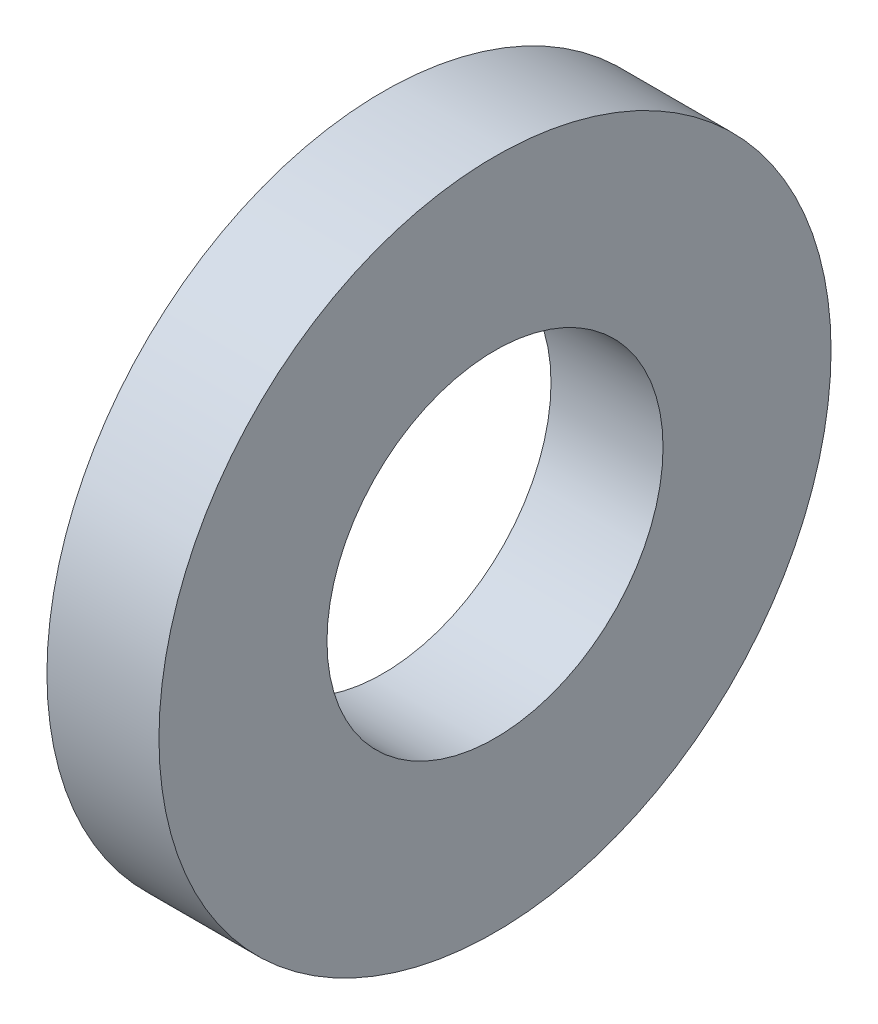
from build123d import *

# Parameters (mm, degrees)
SKETCH1_R           = 13.4874
SKETCH1_R_2         = 6.7437
BOSS_EXTRUDE1_DEPTH = 4.4958


with BuildPart() as part:
    # Sketch1 → Boss-Extrude1 (new body)
    with BuildSketch(Plane(origin=(0, 0, 0), x_dir=(0, 0, -1), z_dir=(1, 0, 0))):
        Circle(SKETCH1_R)
        Circle(SKETCH1_R_2, mode=Mode.SUBTRACT)
    extrude(amount=BOSS_EXTRUDE1_DEPTH)


solid = part.part
